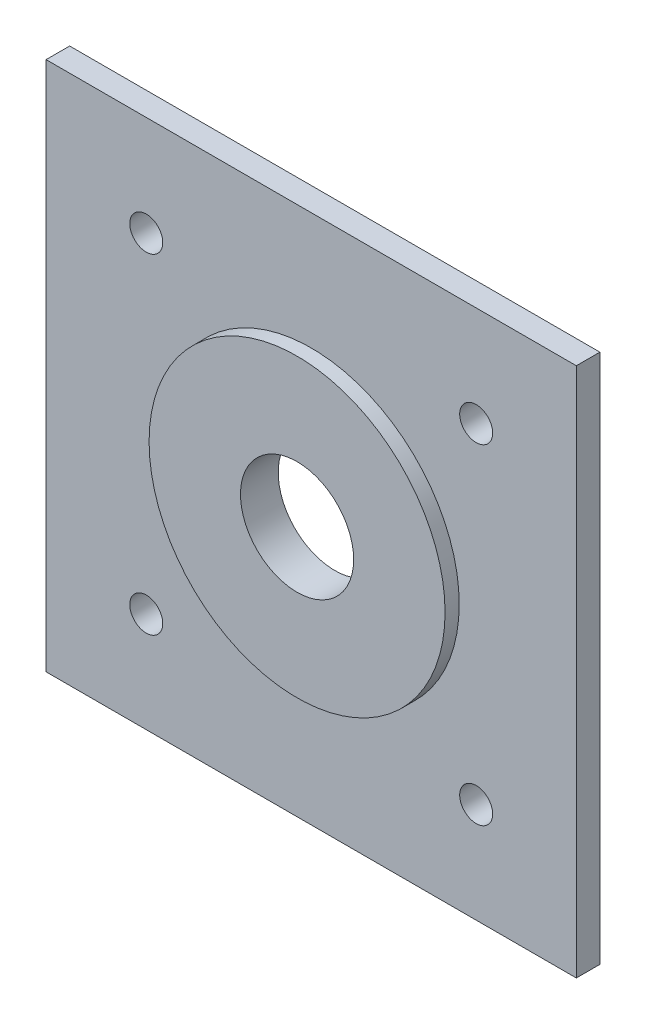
from build123d import *

# Parameters (mm, degrees)
SKETCH2_W           = 112.5
SKETCH2_H           = 112.5
BOSS_EXTRUDE1_DEPTH = 5
SKETCH3_R           = 31.4
BOSS_EXTRUDE2_DEPTH = 3
SKETCH4_R           = 3.5
CUT_EXTRUDE2_DEPTH  = 118
SKETCH5_R           = 12.005
CUT_EXTRUDE3_DEPTH  = 52


with BuildPart() as part:
    # Sketch2 → Boss-Extrude1 (new body)
    with BuildSketch(Plane.XY):
        Rectangle(SKETCH2_W, SKETCH2_H)
    extrude(amount=BOSS_EXTRUDE1_DEPTH)

    # Sketch3 → Boss-Extrude2 (add)
    with BuildSketch(Plane.XY.offset(5)):
        Circle(SKETCH3_R)
    extrude(amount=BOSS_EXTRUDE2_DEPTH)

    # Sketch4 → Cut-Extrude2 (cut)
    with BuildSketch(Plane.XY.offset(8)):
        with Locations((-35, 35)):
            Circle(SKETCH4_R)
        with Locations((35, 35)):
            Circle(SKETCH4_R)
        with Locations((35, -35)):
            Circle(SKETCH4_R)
        with Locations((-35, -35)):
            Circle(SKETCH4_R)
    extrude(amount=-CUT_EXTRUDE2_DEPTH, mode=Mode.SUBTRACT)

    # Sketch5 → Cut-Extrude3 (cut)
    with BuildSketch(Plane.XY.offset(8)):
        Circle(SKETCH5_R)
    extrude(amount=-CUT_EXTRUDE3_DEPTH, mode=Mode.SUBTRACT)


solid = part.part
